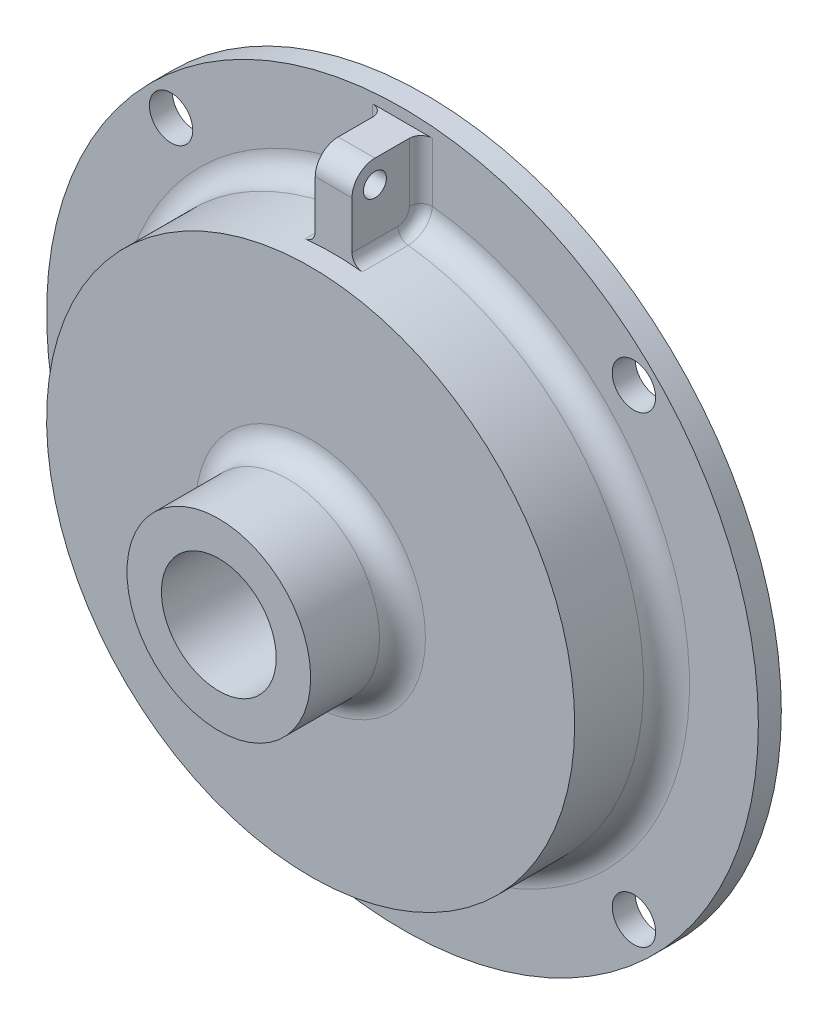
ISO-10303-21;
HEADER;
FILE_DESCRIPTION(('STEP AP214'),'2;1');
FILE_NAME('part.step','',(''),(''),'','','');
FILE_SCHEMA(('AUTOMOTIVE_DESIGN { 1 0 10303 214 1 1 1 1 }'));
ENDSEC;
DATA;
#1=APPLICATION_CONTEXT('core data for automotive mechanical design processes');
#2=APPLICATION_PROTOCOL_DEFINITION('international standard','automotive_design',2000,#1);
#3=PRODUCT_CONTEXT('',#1,'mechanical');
#4=PRODUCT('Part','Part','',(#3));
#5=PRODUCT_RELATED_PRODUCT_CATEGORY('part','',(#4));
#6=PRODUCT_DEFINITION_FORMATION('','',#4);
#7=PRODUCT_DEFINITION_CONTEXT('part definition',#1,'design');
#8=PRODUCT_DEFINITION('design','',#6,#7);
#9=PRODUCT_DEFINITION_SHAPE('','',#8);
#10=(LENGTH_UNIT() NAMED_UNIT(*) SI_UNIT(.MILLI.,.METRE.));
#11=(NAMED_UNIT(*) PLANE_ANGLE_UNIT() SI_UNIT($,.RADIAN.));
#12=(NAMED_UNIT(*) SI_UNIT($,.STERADIAN.) SOLID_ANGLE_UNIT());
#13=UNCERTAINTY_MEASURE_WITH_UNIT(LENGTH_MEASURE(1.E-05),#10,'distance_accuracy_value','');
#14=(GEOMETRIC_REPRESENTATION_CONTEXT(3) GLOBAL_UNCERTAINTY_ASSIGNED_CONTEXT((#13)) GLOBAL_UNIT_ASSIGNED_CONTEXT((#10,
#11,#12)) REPRESENTATION_CONTEXT('',''));
#15=CARTESIAN_POINT('',(0.,0.,0.));
#16=DIRECTION('',(0.,0.,1.));
#17=DIRECTION('',(1.,0.,0.));
#18=AXIS2_PLACEMENT_3D('',#15,#16,#17);
#19=CARTESIAN_POINT('',(0.,0.,3.175));
#20=DIRECTION('',(0.,0.,1.));
#21=DIRECTION('',(1.,0.,0.));
#22=AXIS2_PLACEMENT_3D('',#19,#20,#21);
#23=PLANE('',#22);
#24=CARTESIAN_POINT('',(31.9999999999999,32.0000000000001,3.175));
#25=DIRECTION('',(0.,0.,1.));
#26=DIRECTION('',(1.,0.,0.));
#27=AXIS2_PLACEMENT_3D('',#24,#25,#26);
#28=CIRCLE('',#27,2.99999999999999);
#29=CARTESIAN_POINT('',(34.9999999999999,32.0000000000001,3.175));
#30=VERTEX_POINT('',#29);
#31=EDGE_CURVE('E308',#30,#30,#28,.T.);
#32=ORIENTED_EDGE('',*,*,#31,.F.);
#33=EDGE_LOOP('',(#32));
#34=FACE_BOUND('',#33,.T.);
#35=CARTESIAN_POINT('',(-32.0000000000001,31.9999999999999,3.175));
#36=DIRECTION('',(0.,0.,1.));
#37=DIRECTION('',(1.,0.,0.));
#38=AXIS2_PLACEMENT_3D('',#35,#36,#37);
#39=CIRCLE('',#38,2.99999999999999);
#40=CARTESIAN_POINT('',(-29.0000000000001,31.9999999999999,3.175));
#41=VERTEX_POINT('',#40);
#42=EDGE_CURVE('E314',#41,#41,#39,.T.);
#43=ORIENTED_EDGE('',*,*,#42,.F.);
#44=EDGE_LOOP('',(#43));
#45=FACE_BOUND('',#44,.T.);
#46=CARTESIAN_POINT('',(-31.9999999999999,-32.0000000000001,3.175));
#47=DIRECTION('',(0.,0.,1.));
#48=DIRECTION('',(1.,0.,0.));
#49=AXIS2_PLACEMENT_3D('',#46,#47,#48);
#50=CIRCLE('',#49,2.99999999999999);
#51=CARTESIAN_POINT('',(-29.,-32.0000000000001,3.175));
#52=VERTEX_POINT('',#51);
#53=EDGE_CURVE('E320',#52,#52,#50,.T.);
#54=ORIENTED_EDGE('',*,*,#53,.F.);
#55=EDGE_LOOP('',(#54));
#56=FACE_BOUND('',#55,.T.);
#57=CARTESIAN_POINT('',(32.0000000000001,-31.9999999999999,3.175));
#58=DIRECTION('',(0.,0.,1.));
#59=DIRECTION('',(1.,0.,0.));
#60=AXIS2_PLACEMENT_3D('',#57,#58,#59);
#61=CIRCLE('',#60,2.99999999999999);
#62=CARTESIAN_POINT('',(35.0000000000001,-31.9999999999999,3.175));
#63=VERTEX_POINT('',#62);
#64=EDGE_CURVE('E326',#63,#63,#61,.T.);
#65=ORIENTED_EDGE('',*,*,#64,.F.);
#66=EDGE_LOOP('',(#65));
#67=FACE_BOUND('',#66,.T.);
#68=CARTESIAN_POINT('',(0.,0.,3.175));
#69=DIRECTION('',(0.,0.,1.));
#70=DIRECTION('',(1.,0.,0.));
#71=AXIS2_PLACEMENT_3D('',#68,#69,#70);
#72=CIRCLE('',#71,49.2125);
#73=CARTESIAN_POINT('',(49.2125,0.,3.175));
#74=VERTEX_POINT('',#73);
#75=EDGE_CURVE('E333',#74,#74,#72,.T.);
#76=ORIENTED_EDGE('',*,*,#75,.T.);
#77=EDGE_LOOP('',(#76));
#78=FACE_BOUND('',#77,.T.);
#79=DIRECTION('',(1.,0.,0.));
#80=VECTOR('',#79,1.);
#81=CARTESIAN_POINT('',(-2.54,47.625,3.175));
#82=LINE('',#81,#80);
#83=CARTESIAN_POINT('',(-4.1275,47.625,3.175));
#84=VERTEX_POINT('',#83);
#85=CARTESIAN_POINT('',(4.1275,47.625,3.175));
#86=VERTEX_POINT('',#85);
#87=EDGE_CURVE('E58',#84,#86,#82,.T.);
#88=ORIENTED_EDGE('',*,*,#87,.T.);
#89=DIRECTION('',(0.,-1.,0.));
#90=VECTOR('',#89,1.);
#91=CARTESIAN_POINT('',(4.1275,39.6061365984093,3.175));
#92=LINE('',#91,#90);
#93=CARTESIAN_POINT('',(4.1275,39.4722864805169,3.175));
#94=VERTEX_POINT('',#93);
#95=EDGE_CURVE('E253',#86,#94,#92,.T.);
#96=ORIENTED_EDGE('',*,*,#95,.T.);
#97=CARTESIAN_POINT('',(0.,0.,3.175));
#98=DIRECTION('',(0.,0.,1.));
#99=DIRECTION('',(1.,0.,0.));
#100=AXIS2_PLACEMENT_3D('',#97,#98,#99);
#101=CIRCLE('',#100,39.6875);
#102=CARTESIAN_POINT('',(-4.1275,39.4722864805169,3.175));
#103=VERTEX_POINT('',#102);
#104=EDGE_CURVE('E145',#94,#103,#101,.F.);
#105=ORIENTED_EDGE('',*,*,#104,.T.);
#106=DIRECTION('',(0.,-1.,0.));
#107=VECTOR('',#106,1.);
#108=CARTESIAN_POINT('',(-4.1275,0.,3.175));
#109=LINE('',#108,#107);
#110=EDGE_CURVE('E251',#103,#84,#109,.F.);
#111=ORIENTED_EDGE('',*,*,#110,.T.);
#112=EDGE_LOOP('',(#88,#96,#105,#111));
#113=FACE_BOUND('',#112,.T.);
#114=ADVANCED_FACE('F36',(#34,#45,#56,#67,#78,#113),#23,.T.);
#115=CARTESIAN_POINT('',(0.,0.,15.875));
#116=DIRECTION('',(0.,0.,-1.));
#117=DIRECTION('',(-1.,0.,0.));
#118=AXIS2_PLACEMENT_3D('',#115,#116,#117);
#119=CYLINDRICAL_SURFACE('',#118,36.5125);
#120=CARTESIAN_POINT('',(0.,0.,15.875));
#121=DIRECTION('',(0.,0.,1.));
#122=DIRECTION('',(1.,0.,0.));
#123=AXIS2_PLACEMENT_3D('',#120,#121,#122);
#124=CIRCLE('',#123,36.5125);
#125=CARTESIAN_POINT('',(36.5125,0.,15.875));
#126=VERTEX_POINT('',#125);
#127=EDGE_CURVE('E305',#126,#126,#124,.T.);
#128=ORIENTED_EDGE('',*,*,#127,.F.);
#129=EDGE_LOOP('',(#128));
#130=FACE_BOUND('',#129,.T.);
#131=CARTESIAN_POINT('',(0.,0.,6.35));
#132=DIRECTION('',(0.,0.,1.));
#133=DIRECTION('',(1.,0.,0.));
#134=AXIS2_PLACEMENT_3D('',#131,#132,#133);
#135=CIRCLE('',#134,36.5125);
#136=CARTESIAN_POINT('',(-3.95552083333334,36.2976102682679,6.35));
#137=VERTEX_POINT('',#136);
#138=CARTESIAN_POINT('',(3.95552083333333,36.2976102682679,6.35));
#139=VERTEX_POINT('',#138);
#140=EDGE_CURVE('E283',#137,#139,#135,.T.);
#141=ORIENTED_EDGE('',*,*,#140,.T.);
#142=DIRECTION('',(0.,0.,-1.));
#143=VECTOR('',#142,1.);
#144=CARTESIAN_POINT('',(3.95552083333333,36.2976102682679,15.875));
#145=LINE('',#144,#143);
#146=CARTESIAN_POINT('',(3.95552083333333,36.2976102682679,12.7));
#147=VERTEX_POINT('',#146);
#148=EDGE_CURVE('E151',#139,#147,#145,.F.);
#149=ORIENTED_EDGE('',*,*,#148,.T.);
#150=CARTESIAN_POINT('',(0.,0.,12.7));
#151=DIRECTION('',(0.,0.,-1.));
#152=DIRECTION('',(-1.,0.,0.));
#153=AXIS2_PLACEMENT_3D('',#150,#151,#152);
#154=CIRCLE('',#153,36.5125);
#155=CARTESIAN_POINT('',(-3.95552083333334,36.2976102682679,12.7));
#156=VERTEX_POINT('',#155);
#157=EDGE_CURVE('E142',#156,#147,#154,.T.);
#158=ORIENTED_EDGE('',*,*,#157,.F.);
#159=DIRECTION('',(0.,0.,-1.));
#160=VECTOR('',#159,1.);
#161=CARTESIAN_POINT('',(-3.95552083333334,36.2976102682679,15.875));
#162=LINE('',#161,#160);
#163=EDGE_CURVE('E136',#156,#137,#162,.T.);
#164=ORIENTED_EDGE('',*,*,#163,.T.);
#165=EDGE_LOOP('',(#141,#149,#158,#164));
#166=FACE_BOUND('',#165,.T.);
#167=ADVANCED_FACE('F345',(#130,#166),#119,.T.);
#168=CARTESIAN_POINT('',(0.,0.,6.35));
#169=DIRECTION('',(0.,0.,1.));
#170=DIRECTION('',(1.,0.,0.));
#171=AXIS2_PLACEMENT_3D('',#168,#169,#170);
#172=TOROIDAL_SURFACE('',#171,39.6875,3.175);
#173=ORIENTED_EDGE('',*,*,#104,.F.);
#174=CARTESIAN_POINT('',(4.18164310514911,40.5273921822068,3.35542367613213));
#175=CARTESIAN_POINT('',(2.54,40.5459208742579,3.30255416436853));
#176=CARTESIAN_POINT('',(2.54,40.0026513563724,4.85271183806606));
#177=CARTESIAN_POINT('',(4.17735707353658,40.4427545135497,3.32560729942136));
#178=CARTESIAN_POINT('',(2.54,40.4584003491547,3.27658082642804));
#179=CARTESIAN_POINT('',(2.54,39.96011140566,4.83780364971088));
#180=CARTESIAN_POINT('',(4.17299607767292,40.3569071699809,3.29939836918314));
#181=CARTESIAN_POINT('',(2.54,40.3698846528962,3.25440113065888));
#182=CARTESIAN_POINT('',(2.54,39.9169623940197,4.8246991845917));
#183=CARTESIAN_POINT('',(4.16414950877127,40.1833322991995,3.25433784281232));
#184=CARTESIAN_POINT('',(2.54,40.1916864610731,3.21776571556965));
#185=CARTESIAN_POINT('',(2.54,39.8297170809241,4.80216892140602));
#186=CARTESIAN_POINT('',(4.15966394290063,40.0956048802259,3.23548582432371));
#187=CARTESIAN_POINT('',(2.54,40.1020134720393,3.20328878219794));
#188=CARTESIAN_POINT('',(2.54,39.7856208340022,4.79274291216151));
#189=CARTESIAN_POINT('',(4.14607190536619,39.8306740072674,3.19022168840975));
#190=CARTESIAN_POINT('',(2.54,39.8327789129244,3.17154593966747));
#191=CARTESIAN_POINT('',(2.54,39.6524495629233,4.77011084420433));
#192=CARTESIAN_POINT('',(4.13681647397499,39.6514527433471,3.17500699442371));
#193=CARTESIAN_POINT('',(2.54,39.6519801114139,3.16566305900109));
#194=CARTESIAN_POINT('',(2.54,39.5623567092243,4.76250349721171));
#195=CARTESIAN_POINT('',(4.11817420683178,39.2929409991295,3.17499299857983));
#196=CARTESIAN_POINT('',(2.54,39.2934661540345,3.18429156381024));
#197=CARTESIAN_POINT('',(2.54,39.3821261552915,4.76249649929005));
#198=CARTESIAN_POINT('',(4.10878724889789,39.1136506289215,3.19022413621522));
#199=CARTESIAN_POINT('',(2.54,39.1157385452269,3.20865546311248));
#200=CARTESIAN_POINT('',(2.54,39.2919885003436,4.77011206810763));
#201=CARTESIAN_POINT('',(4.09015568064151,38.7601767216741,3.25070280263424));
#202=CARTESIAN_POINT('',(2.54,38.7683278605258,3.28634323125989));
#203=CARTESIAN_POINT('',(2.54,39.1142707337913,4.80035140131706));
#204=CARTESIAN_POINT('',(4.08091104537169,38.5859922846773,3.29594500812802));
#205=CARTESIAN_POINT('',(2.54,38.598573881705,3.3395012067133));
#206=CARTESIAN_POINT('',(2.54,39.0266901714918,4.82297250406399));
#207=CARTESIAN_POINT('',(4.06283875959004,38.2476492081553,3.41520930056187));
#208=CARTESIAN_POINT('',(2.54,38.2714996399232,3.47265785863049));
#209=CARTESIAN_POINT('',(2.54,38.8565608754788,4.88260465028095));
#210=CARTESIAN_POINT('',(4.05401116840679,38.0834919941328,3.48923546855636));
#211=CARTESIAN_POINT('',(2.54,38.1140639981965,3.5525334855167));
#212=CARTESIAN_POINT('',(2.54,38.7740128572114,4.91961773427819));
#213=CARTESIAN_POINT('',(4.03704864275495,37.7698994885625,3.66402328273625));
#214=CARTESIAN_POINT('',(2.54,37.8155483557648,3.73642917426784));
#215=CARTESIAN_POINT('',(2.54,38.6163119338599,5.00701164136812));
#216=CARTESIAN_POINT('',(4.02891377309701,37.6204655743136,3.76478742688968));
#217=CARTESIAN_POINT('',(2.54,37.6743195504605,3.8403710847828));
#218=CARTESIAN_POINT('',(2.54,38.541159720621,5.05739371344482));
#219=CARTESIAN_POINT('',(4.01362149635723,37.3409931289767,3.98996063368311));
#220=CARTESIAN_POINT('',(2.54,37.4119377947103,4.06894628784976));
#221=CARTESIAN_POINT('',(2.54,38.4006031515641,5.16998031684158));
#222=CARTESIAN_POINT('',(4.00646176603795,37.2109084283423,4.11431174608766));
#223=CARTESIAN_POINT('',(2.54,37.2905724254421,4.19350133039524));
#224=CARTESIAN_POINT('',(2.54,38.335175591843,5.23215587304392));
#225=CARTESIAN_POINT('',(3.99333719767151,36.9734608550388,4.38333826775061));
#226=CARTESIAN_POINT('',(2.54,37.0702855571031,4.45996271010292));
#227=CARTESIAN_POINT('',(2.54,38.2157441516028,5.36666913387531));
#228=CARTESIAN_POINT('',(3.98737253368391,36.8661012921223,4.52801663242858));
#229=CARTESIAN_POINT('',(2.54,36.971202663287,4.60190105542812));
#230=CARTESIAN_POINT('',(2.54,38.1617419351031,5.43900831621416));
#231=CARTESIAN_POINT('',(3.97687425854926,36.6777509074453,4.83284333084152));
#232=CARTESIAN_POINT('',(2.54,36.798155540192,4.89857518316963));
#233=CARTESIAN_POINT('',(2.54,38.0669983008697,5.59142166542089));
#234=CARTESIAN_POINT('',(3.97233377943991,36.5966334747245,4.99291240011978));
#235=CARTESIAN_POINT('',(2.54,36.7239275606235,5.05332299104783));
#236=CARTESIAN_POINT('',(2.54,38.0261932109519,5.67145620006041));
#237=CARTESIAN_POINT('',(3.96481003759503,36.4625045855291,5.3242894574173));
#238=CARTESIAN_POINT('',(2.54,36.6015930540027,5.37195514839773));
#239=CARTESIAN_POINT('',(2.54,37.9587200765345,5.83714472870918));
#240=CARTESIAN_POINT('',(3.96182512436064,36.4094633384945,5.49558531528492));
#241=CARTESIAN_POINT('',(2.54,36.5533484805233,5.53595146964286));
#242=CARTESIAN_POINT('',(2.54,37.9320370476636,5.9227926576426));
#243=CARTESIAN_POINT('',(3.95692027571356,36.3223814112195,5.89322764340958));
#244=CARTESIAN_POINT('',(2.54,36.4743136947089,5.91537906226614));
#245=CARTESIAN_POINT('',(2.54,37.8882290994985,6.12161382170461));
#246=CARTESIAN_POINT('',(3.9555216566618,36.2976254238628,6.12171939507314));
#247=CARTESIAN_POINT('',(2.54,36.4518799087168,6.13287630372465));
#248=CARTESIAN_POINT('',(2.54,37.8757748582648,6.23585969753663));
#249=CARTESIAN_POINT('',(3.95552019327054,36.2975984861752,6.52746734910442));
#250=CARTESIAN_POINT('',(2.54,36.4518555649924,6.51879379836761));
#251=CARTESIAN_POINT('',(2.54,37.8757613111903,6.43873367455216));
#252=CARTESIAN_POINT('',(3.95636433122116,36.3125391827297,6.70480708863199));
#253=CARTESIAN_POINT('',(2.54,36.4653926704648,6.68754708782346));
#254=CARTESIAN_POINT('',(2.54,37.8832776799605,6.52740354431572));
#255=CARTESIAN_POINT('',(3.959701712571,36.3717606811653,7.05520561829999));
#256=CARTESIAN_POINT('',(2.54,36.5191030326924,7.0215028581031));
#257=CARTESIAN_POINT('',(2.54,37.9130701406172,6.70260280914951));
#258=CARTESIAN_POINT('',(3.9622017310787,36.4161620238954,7.22824377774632));
#259=CARTESIAN_POINT('',(2.54,36.5594364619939,7.18684096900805));
#260=CARTESIAN_POINT('',(2.54,37.9354068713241,6.7891218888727));
#261=CARTESIAN_POINT('',(3.96550570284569,36.4749456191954,7.39635872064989));
#262=CARTESIAN_POINT('',(2.54,36.6129150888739,7.34791496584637));
#263=CARTESIAN_POINT('',(2.54,37.964978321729,6.87317936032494));
#264=(BOUNDED_SURFACE() B_SPLINE_SURFACE(3,2,((#174,#175,#176),(#177,#178,#179),(#180,#181,
#182),(#183,#184,#185),(#186,#187,#188),(#189,#190,#191),(#192,#193,#194),(#195,#196,#197),
(#198,#199,#200),(#201,#202,#203),(#204,#205,#206),(#207,#208,#209),(#210,#211,#212),(#213,#214,
#215),(#216,#217,#218),(#219,#220,#221),(#222,#223,#224),(#225,#226,#227),(#228,#229,#230),
(#231,#232,#233),(#234,#235,#236),(#237,#238,#239),(#240,#241,#242),(#243,#244,#245),(#246,#247,
#248),(#249,#250,#251),(#252,#253,#254),(#255,#256,#257),(#258,#259,#260),(#261,#262,#263)),
.UNSPECIFIED.,.F.,.F.,.F.) B_SPLINE_SURFACE_WITH_KNOTS((4,2,2,2,2,2,2,2,2,2,2,2,2,2,4),(3,3),
(0.,0.135146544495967,0.270285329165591,0.540138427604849,0.810261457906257,1.08033658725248,
1.35045002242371,1.62058870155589,1.89007208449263,2.15959468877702,2.42779682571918,
2.69571381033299,3.03757625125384,3.30334311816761,3.5702041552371),(0.,1.),
.UNSPECIFIED.) GEOMETRIC_REPRESENTATION_ITEM() RATIONAL_B_SPLINE_SURFACE(((1.,0.694943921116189,
1.),(1.,0.695915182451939,1.),(1.,0.696901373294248,1.),(1.,0.698897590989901,1.),(1.,
0.699907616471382,1.),(1.,0.702961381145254,1.),(1.,0.70503189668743,1.),(1.,0.709183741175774,
1.),(1.,0.711265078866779,1.),(1.,0.715378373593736,1.),(1.,0.717410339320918,1.),(1.,
0.721366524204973,1.),(1.,0.723290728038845,1.),(1.,0.726974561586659,1.),(1.,0.728734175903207,
1.),(1.,0.732031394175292,1.),(1.,0.733569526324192,1.),(1.,0.736381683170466,1.),(1.,
0.737655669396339,1.),(1.,0.739893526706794,1.),(1.,0.740858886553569,1.),(1.,0.742456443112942,
1.),(1.,0.743088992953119,1.),(1.,0.744127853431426,1.),(1.,0.744423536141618,1.),(1.,
0.744423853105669,1.),(1.,0.744245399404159,1.),(1.,0.743538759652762,1.),(1.,0.743009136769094,
1.),(1.,0.742308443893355,1.))) REPRESENTATION_ITEM('') SURFACE());
#265=CARTESIAN_POINT('',(4.18164310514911,40.5273921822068,3.35542367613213));
#266=CARTESIAN_POINT('',(4.17735707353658,40.4427545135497,3.32560729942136));
#267=CARTESIAN_POINT('',(4.17299607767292,40.3569071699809,3.29939836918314));
#268=CARTESIAN_POINT('',(4.16414950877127,40.1833322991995,3.25433784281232));
#269=CARTESIAN_POINT('',(4.15966394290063,40.0956048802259,3.23548582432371));
#270=CARTESIAN_POINT('',(4.14607190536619,39.8306740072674,3.19022168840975));
#271=CARTESIAN_POINT('',(4.13681647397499,39.6514527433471,3.17500699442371));
#272=CARTESIAN_POINT('',(4.11817420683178,39.2929409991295,3.17499299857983));
#273=CARTESIAN_POINT('',(4.10878724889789,39.1136506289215,3.19022413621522));
#274=CARTESIAN_POINT('',(4.09015568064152,38.7601767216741,3.25070280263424));
#275=CARTESIAN_POINT('',(4.08091104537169,38.5859922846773,3.29594500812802));
#276=CARTESIAN_POINT('',(4.06283875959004,38.2476492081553,3.41520930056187));
#277=CARTESIAN_POINT('',(4.05401116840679,38.0834919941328,3.48923546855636));
#278=CARTESIAN_POINT('',(4.03704864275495,37.7698994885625,3.66402328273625));
#279=CARTESIAN_POINT('',(4.02891377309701,37.6204655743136,3.76478742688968));
#280=CARTESIAN_POINT('',(4.01362149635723,37.3409931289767,3.98996063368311));
#281=CARTESIAN_POINT('',(4.00646176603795,37.2109084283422,4.11431174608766));
#282=CARTESIAN_POINT('',(3.99333719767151,36.9734608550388,4.38333826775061));
#283=CARTESIAN_POINT('',(3.98737253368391,36.8661012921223,4.52801663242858));
#284=CARTESIAN_POINT('',(3.97687425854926,36.6777509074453,4.83284333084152));
#285=CARTESIAN_POINT('',(3.97233377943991,36.5966334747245,4.99291240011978));
#286=CARTESIAN_POINT('',(3.96481003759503,36.4625045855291,5.3242894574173));
#287=CARTESIAN_POINT('',(3.96182512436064,36.4094633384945,5.49558531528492));
#288=CARTESIAN_POINT('',(3.95692027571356,36.3223814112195,5.89322764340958));
#289=CARTESIAN_POINT('',(3.9555216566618,36.2976254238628,6.12171939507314));
#290=CARTESIAN_POINT('',(3.95552019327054,36.2975984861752,6.52746734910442));
#291=CARTESIAN_POINT('',(3.95636433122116,36.3125391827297,6.70480708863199));
#292=CARTESIAN_POINT('',(3.959701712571,36.3717606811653,7.05520561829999));
#293=CARTESIAN_POINT('',(3.9622017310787,36.4161620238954,7.22824377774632));
#294=CARTESIAN_POINT('',(3.96550570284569,36.4749456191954,7.39635872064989));
#295=B_SPLINE_CURVE_WITH_KNOTS('',3,(#265,#266,#267,#268,#269,#270,#271,#272,#273,#274,#275,
#276,#277,#278,#279,#280,#281,#282,#283,#284,#285,#286,#287,#288,#289,#290,#291,#292,#293,#294),
.UNSPECIFIED.,.F.,.F.,(4,2,2,2,2,2,2,2,2,2,2,2,2,2,4),(0.,0.135146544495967,0.270285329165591,
0.540138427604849,0.810261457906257,1.08033658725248,1.35045002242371,1.62058870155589,
1.89007208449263,2.15959468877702,2.42779682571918,2.69571381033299,3.03757625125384,
3.30334311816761,3.5702041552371),.UNSPECIFIED.);
#296=EDGE_CURVE('E243',#94,#139,#295,.T.);
#297=ORIENTED_EDGE('',*,*,#296,.T.);
#298=ORIENTED_EDGE('',*,*,#140,.F.);
#299=CARTESIAN_POINT('',(-3.96550570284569,36.4749456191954,7.39635872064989));
#300=CARTESIAN_POINT('',(-2.54,36.6129150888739,7.34791496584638));
#301=CARTESIAN_POINT('',(-2.54,37.964978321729,6.87317936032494));
#302=CARTESIAN_POINT('',(-3.96386052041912,36.4456596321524,7.31244061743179));
#303=CARTESIAN_POINT('',(-2.54,36.5862605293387,7.26747359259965));
#304=CARTESIAN_POINT('',(-2.54,37.9502458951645,6.83122030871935));
#305=CARTESIAN_POINT('',(-3.96241213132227,36.4199078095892,7.22731888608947));
#306=CARTESIAN_POINT('',(-2.54,36.5628409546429,7.18600002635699));
#307=CARTESIAN_POINT('',(-2.54,37.9372912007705,6.78865944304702));
#308=CARTESIAN_POINT('',(-3.95991943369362,36.375622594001,7.05519929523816));
#309=CARTESIAN_POINT('',(-2.54,36.5226091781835,7.02153331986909));
#310=CARTESIAN_POINT('',(-2.54,37.9150129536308,6.70259964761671));
#311=CARTESIAN_POINT('',(-3.95887510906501,36.357088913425,6.96820151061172));
#312=CARTESIAN_POINT('',(-2.54,36.5057873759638,6.93852233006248));
#313=CARTESIAN_POINT('',(-2.54,37.9056892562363,6.6591007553));
#314=CARTESIAN_POINT('',(-3.95636653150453,36.3125856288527,6.70546681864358));
#315=CARTESIAN_POINT('',(-2.54,36.4654342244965,6.68817541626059));
#316=CARTESIAN_POINT('',(-2.54,37.8833010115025,6.5277334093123));
#317=CARTESIAN_POINT('',(-3.95552123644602,36.2976172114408,6.52771107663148));
#318=CARTESIAN_POINT('',(-2.54,36.4518725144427,6.51902588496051));
#319=CARTESIAN_POINT('',(-2.54,37.8757707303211,6.43885553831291));
#320=CARTESIAN_POINT('',(-3.9555204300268,36.2976033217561,6.17220346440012));
#321=CARTESIAN_POINT('',(-2.54,36.4518599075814,6.18089287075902));
#322=CARTESIAN_POINT('',(-2.54,37.8757637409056,6.26110173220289));
#323=CARTESIAN_POINT('',(-3.95636573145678,36.3125722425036,5.99445163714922));
#324=CARTESIAN_POINT('',(-2.54,36.4654220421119,6.01174700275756));
#325=CARTESIAN_POINT('',(-2.54,37.8832942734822,6.17222581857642));
#326=CARTESIAN_POINT('',(-3.95971478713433,36.3719843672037,5.64402081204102));
#327=CARTESIAN_POINT('',(-2.54,36.5193066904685,5.67775874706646));
#328=CARTESIAN_POINT('',(-2.54,37.9131827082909,5.99701040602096));
#329=CARTESIAN_POINT('',(-3.96221821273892,36.4164217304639,5.47134081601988));
#330=CARTESIAN_POINT('',(-2.54,36.559674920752,5.51276159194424));
#331=CARTESIAN_POINT('',(-2.54,37.9355376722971,5.91067040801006));
#332=CARTESIAN_POINT('',(-3.96879290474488,36.5334643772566,5.13595644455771));
#333=CARTESIAN_POINT('',(-2.54,36.6662507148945,5.19112038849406));
#334=CARTESIAN_POINT('',(-2.54,37.994416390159,5.74297822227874));
#335=CARTESIAN_POINT('',(-3.97286403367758,36.6060671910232,4.97325119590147));
#336=CARTESIAN_POINT('',(-2.54,36.732552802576,5.03434604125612));
#337=CARTESIAN_POINT('',(-2.54,38.0309389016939,5.66162559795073));
#338=CARTESIAN_POINT('',(-3.98243029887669,36.7773369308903,4.662347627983));
#339=CARTESIAN_POINT('',(-2.54,36.8895262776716,4.73299568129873));
#340=CARTESIAN_POINT('',(-2.54,38.1170922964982,5.50617381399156));
#341=CARTESIAN_POINT('',(-3.98792562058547,36.8760072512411,4.51415120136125));
#342=CARTESIAN_POINT('',(-2.54,36.9803334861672,4.58832951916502));
#343=CARTESIAN_POINT('',(-2.54,38.1667248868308,5.43207560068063));
#344=CARTESIAN_POINT('',(-4.00016593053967,37.096846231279,4.23606432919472));
#345=CARTESIAN_POINT('',(-2.54,37.1845533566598,4.314545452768));
#346=CARTESIAN_POINT('',(-2.54,38.2778052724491,5.29303216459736));
#347=CARTESIAN_POINT('',(-4.00691405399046,37.2190738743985,4.10622128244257));
#348=CARTESIAN_POINT('',(-2.54,37.2981778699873,4.18542455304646));
#349=CARTESIAN_POINT('',(-2.54,38.339282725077,5.22811064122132));
#350=CARTESIAN_POINT('',(-4.02142580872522,37.4833934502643,3.86886173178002));
#351=CARTESIAN_POINT('',(-2.54,37.5453465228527,3.94656479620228));
#352=CARTESIAN_POINT('',(-2.54,38.4722223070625,5.10943086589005));
#353=CARTESIAN_POINT('',(-4.02918961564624,37.6254888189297,3.76134909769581));
#354=CARTESIAN_POINT('',(-2.54,37.6790567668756,3.83683770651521));
#355=CARTESIAN_POINT('',(-2.54,38.5436861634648,5.05567454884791));
#356=CARTESIAN_POINT('',(-4.04552882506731,37.9263814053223,3.57106039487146));
#357=CARTESIAN_POINT('',(-2.54,37.9641416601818,3.63929294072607));
#358=CARTESIAN_POINT('',(-2.54,38.6950055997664,4.96053019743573));
#359=CARTESIAN_POINT('',(-4.05410876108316,38.0852725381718,3.48843456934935));
#360=CARTESIAN_POINT('',(-2.54,38.1157665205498,3.5516738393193));
#361=CARTESIAN_POINT('',(-2.54,38.7749083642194,4.9192172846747));
#362=CARTESIAN_POINT('',(-4.0717679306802,38.4144708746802,3.35110687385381));
#363=CARTESIAN_POINT('',(-2.54,38.4323282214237,3.40197931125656));
#364=CARTESIAN_POINT('',(-2.54,38.9404454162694,4.85055343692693));
#365=CARTESIAN_POINT('',(-4.08084670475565,38.5847676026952,3.29637976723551));
#366=CARTESIAN_POINT('',(-2.54,38.5973814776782,3.33999077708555));
#367=CARTESIAN_POINT('',(-2.54,39.0260744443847,4.82318988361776));
#368=CARTESIAN_POINT('',(-4.09623072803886,38.8753034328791,3.22931466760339));
#369=CARTESIAN_POINT('',(-2.54,38.8810436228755,3.25946594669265));
#370=CARTESIAN_POINT('',(-2.54,39.172154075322,4.78965733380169));
#371=CARTESIAN_POINT('',(-4.10247573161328,38.9937714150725,3.20897494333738));
#372=CARTESIAN_POINT('',(-2.54,38.9974684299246,3.23335877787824));
#373=CARTESIAN_POINT('',(-2.54,39.2317168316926,4.77948747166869));
#374=CARTESIAN_POINT('',(-4.11498864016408,39.2322281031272,3.18181315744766));
#375=CARTESIAN_POINT('',(-2.54,39.2331650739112,3.19421185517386));
#376=CARTESIAN_POINT('',(-2.54,39.3516024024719,4.76590657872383));
#377=CARTESIAN_POINT('',(-4.12125654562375,39.3522168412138,3.17499138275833));
#378=CARTESIAN_POINT('',(-2.54,39.3524524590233,3.18122275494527));
#379=CARTESIAN_POINT('',(-2.54,39.4119252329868,4.76249569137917));
#380=CARTESIAN_POINT('',(-4.13679822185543,39.6511032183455,3.17501283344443));
#381=CARTESIAN_POINT('',(-2.54,39.6516284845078,3.16568710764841));
#382=CARTESIAN_POINT('',(-2.54,39.5621809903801,4.76250641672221));
#383=CARTESIAN_POINT('',(-4.14604221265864,39.830099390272,3.19017507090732));
#384=CARTESIAN_POINT('',(-2.54,39.8321975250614,3.17152918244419));
#385=CARTESIAN_POINT('',(-2.54,39.6521607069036,4.77008753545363));
#386=CARTESIAN_POINT('',(-4.15962981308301,40.0949375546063,3.235346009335));
#387=CARTESIAN_POINT('',(-2.54,40.101332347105,3.20318244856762));
#388=CARTESIAN_POINT('',(-2.54,39.7852854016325,4.79267300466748));
#389=CARTESIAN_POINT('',(-4.16412306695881,40.1828141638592,3.25421340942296));
#390=CARTESIAN_POINT('',(-2.54,40.1911560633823,3.2176668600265));
#391=CARTESIAN_POINT('',(-2.54,39.8294566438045,4.80210670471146));
#392=CARTESIAN_POINT('',(-4.17298344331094,40.3566586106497,3.2993238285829));
#393=CARTESIAN_POINT('',(-2.54,40.3696287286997,3.25433836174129));
#394=CARTESIAN_POINT('',(-2.54,39.916837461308,4.82466191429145));
#395=CARTESIAN_POINT('',(-4.17735059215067,40.442626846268,3.32556529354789));
#396=CARTESIAN_POINT('',(-2.54,40.4582685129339,3.27654470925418));
#397=CARTESIAN_POINT('',(-2.54,39.960047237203,4.83778264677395));
#398=CARTESIAN_POINT('',(-4.18164310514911,40.5273921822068,3.35542367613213));
#399=CARTESIAN_POINT('',(-2.54,40.5459208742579,3.30255416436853));
#400=CARTESIAN_POINT('',(-2.54,40.0026513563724,4.85271183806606));
#401=(BOUNDED_SURFACE() B_SPLINE_SURFACE(3,2,((#299,#300,#301),(#302,#303,#304),(#305,#306,
#307),(#308,#309,#310),(#311,#312,#313),(#314,#315,#316),(#317,#318,#319),(#320,#321,#322),
(#323,#324,#325),(#326,#327,#328),(#329,#330,#331),(#332,#333,#334),(#335,#336,#337),(#338,#339,
#340),(#341,#342,#343),(#344,#345,#346),(#347,#348,#349),(#350,#351,#352),(#353,#354,#355),
(#356,#357,#358),(#359,#360,#361),(#362,#363,#364),(#365,#366,#367),(#368,#369,#370),(#371,#372,
#373),(#374,#375,#376),(#377,#378,#379),(#380,#381,#382),(#383,#384,#385),(#386,#387,#388),
(#389,#390,#391),(#392,#393,#394),(#395,#396,#397),(#398,#399,#400)),.UNSPECIFIED.,.F.,.F.,
.F.) B_SPLINE_SURFACE_WITH_KNOTS((4,2,2,2,2,2,2,2,2,2,2,2,2,2,2,2,4),(3,3),(0.,
0.133329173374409,0.266653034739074,0.532865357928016,0.799205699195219,1.06549326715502,
1.33175749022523,1.59805640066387,1.86503094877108,2.13205172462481,2.40065362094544,
2.66901211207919,2.84992337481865,3.0308384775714,3.30027085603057,3.4356386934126,
3.57097802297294),(0.,1.),
.UNSPECIFIED.) GEOMETRIC_REPRESENTATION_ITEM() RATIONAL_B_SPLINE_SURFACE(((1.,0.742308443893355,
1.),(1.,0.742657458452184,1.),(1.,0.74296449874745,1.),(1.,0.743492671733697,1.),(1.,
0.743713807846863,1.),(1.,0.744244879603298,1.),(1.,0.744423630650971,1.),(1.,0.744423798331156,
1.),(1.,0.744245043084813,1.),(1.,0.743536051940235,1.),(1.,0.743005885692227,1.),(1.,
0.741611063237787,1.),(1.,0.740746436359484,1.),(1.,0.738709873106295,1.),(1.,0.737537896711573,
1.),(1.,0.734919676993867,1.),(1.,0.733472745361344,1.),(1.,0.73035034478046,1.),(1.,
0.728674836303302,1.),(1.,0.725135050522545,1.),(1.,0.723269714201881,1.),(1.,0.71941442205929,
1.),(1.,0.717424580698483,1.),(1.,0.714038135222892,1.),(1.,0.712659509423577,1.),(1.,
0.709889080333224,1.),(1.,0.708497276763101,1.),(1.,0.705035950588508,1.),(1.,0.702968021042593,
1.),(1.,0.699915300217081,1.),(1.,0.69890355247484,1.),(1.,0.696904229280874,1.),(1.,
0.69591664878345,1.),(1.,0.694943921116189,1.))) REPRESENTATION_ITEM('') SURFACE());
#402=CARTESIAN_POINT('',(-3.96550570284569,36.4749456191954,7.39635872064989));
#403=CARTESIAN_POINT('',(-3.96386052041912,36.4456596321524,7.31244061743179));
#404=CARTESIAN_POINT('',(-3.96241213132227,36.4199078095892,7.22731888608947));
#405=CARTESIAN_POINT('',(-3.95991943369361,36.375622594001,7.05519929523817));
#406=CARTESIAN_POINT('',(-3.95887510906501,36.357088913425,6.96820151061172));
#407=CARTESIAN_POINT('',(-3.95636653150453,36.3125856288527,6.70546681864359));
#408=CARTESIAN_POINT('',(-3.95552123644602,36.2976172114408,6.52771107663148));
#409=CARTESIAN_POINT('',(-3.9555204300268,36.2976033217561,6.17220346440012));
#410=CARTESIAN_POINT('',(-3.95636573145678,36.3125722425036,5.99445163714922));
#411=CARTESIAN_POINT('',(-3.95971478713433,36.3719843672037,5.64402081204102));
#412=CARTESIAN_POINT('',(-3.96221821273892,36.4164217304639,5.47134081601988));
#413=CARTESIAN_POINT('',(-3.96879290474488,36.5334643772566,5.13595644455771));
#414=CARTESIAN_POINT('',(-3.97286403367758,36.6060671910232,4.97325119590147));
#415=CARTESIAN_POINT('',(-3.98243029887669,36.7773369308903,4.662347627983));
#416=CARTESIAN_POINT('',(-3.98792562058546,36.8760072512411,4.51415120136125));
#417=CARTESIAN_POINT('',(-4.00016593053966,37.096846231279,4.23606432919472));
#418=CARTESIAN_POINT('',(-4.00691405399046,37.2190738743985,4.10622128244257));
#419=CARTESIAN_POINT('',(-4.02142580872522,37.4833934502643,3.86886173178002));
#420=CARTESIAN_POINT('',(-4.02918961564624,37.6254888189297,3.76134909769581));
#421=CARTESIAN_POINT('',(-4.04552882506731,37.9263814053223,3.57106039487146));
#422=CARTESIAN_POINT('',(-4.05410876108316,38.0852725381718,3.48843456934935));
#423=CARTESIAN_POINT('',(-4.0717679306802,38.4144708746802,3.35110687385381));
#424=CARTESIAN_POINT('',(-4.08084670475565,38.5847676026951,3.29637976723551));
#425=CARTESIAN_POINT('',(-4.09623072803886,38.8753034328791,3.22931466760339));
#426=CARTESIAN_POINT('',(-4.10247573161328,38.9937714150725,3.20897494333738));
#427=CARTESIAN_POINT('',(-4.11498864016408,39.2322281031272,3.18181315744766));
#428=CARTESIAN_POINT('',(-4.12125654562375,39.3522168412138,3.17499138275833));
#429=CARTESIAN_POINT('',(-4.13679822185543,39.6511032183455,3.17501283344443));
#430=CARTESIAN_POINT('',(-4.14604221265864,39.830099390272,3.19017507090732));
#431=CARTESIAN_POINT('',(-4.15962981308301,40.0949375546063,3.235346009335));
#432=CARTESIAN_POINT('',(-4.16412306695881,40.1828141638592,3.25421340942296));
#433=CARTESIAN_POINT('',(-4.17298344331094,40.3566586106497,3.2993238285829));
#434=CARTESIAN_POINT('',(-4.17735059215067,40.442626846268,3.32556529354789));
#435=CARTESIAN_POINT('',(-4.18164310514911,40.5273921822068,3.35542367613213));
#436=B_SPLINE_CURVE_WITH_KNOTS('',3,(#402,#403,#404,#405,#406,#407,#408,#409,#410,#411,#412,
#413,#414,#415,#416,#417,#418,#419,#420,#421,#422,#423,#424,#425,#426,#427,#428,#429,#430,#431,
#432,#433,#434,#435),.UNSPECIFIED.,.F.,.F.,(4,2,2,2,2,2,2,2,2,2,2,2,2,2,2,2,4),(0.,
0.133329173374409,0.266653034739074,0.532865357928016,0.799205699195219,1.06549326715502,
1.33175749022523,1.59805640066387,1.86503094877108,2.13205172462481,2.40065362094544,
2.66901211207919,2.84992337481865,3.0308384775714,3.30027085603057,3.4356386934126,
3.57097802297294),.UNSPECIFIED.);
#437=EDGE_CURVE('E237',#137,#103,#436,.T.);
#438=ORIENTED_EDGE('',*,*,#437,.T.);
#439=EDGE_LOOP('',(#173,#297,#298,#438));
#440=FACE_BOUND('',#439,.T.);
#441=ADVANCED_FACE('F191',(#440),#172,.F.);
#442=CARTESIAN_POINT('',(0.,0.,15.875));
#443=DIRECTION('',(0.,0.,1.));
#444=DIRECTION('',(1.,0.,0.));
#445=AXIS2_PLACEMENT_3D('',#442,#443,#444);
#446=PLANE('',#445);
#447=CARTESIAN_POINT('',(0.,0.,15.875));
#448=DIRECTION('',(0.,0.,1.));
#449=DIRECTION('',(1.,0.,0.));
#450=AXIS2_PLACEMENT_3D('',#447,#448,#449);
#451=CIRCLE('',#450,15.875);
#452=CARTESIAN_POINT('',(15.875,0.,15.875));
#453=VERTEX_POINT('',#452);
#454=EDGE_CURVE('E341',#453,#453,#451,.F.);
#455=ORIENTED_EDGE('',*,*,#454,.T.);
#456=EDGE_LOOP('',(#455));
#457=FACE_BOUND('',#456,.T.);
#458=ORIENTED_EDGE('',*,*,#127,.T.);
#459=EDGE_LOOP('',(#458));
#460=FACE_BOUND('',#459,.T.);
#461=ADVANCED_FACE('F371',(#457,#460),#446,.T.);
#462=CARTESIAN_POINT('',(0.,0.,3.175));
#463=DIRECTION('',(0.,0.,-1.));
#464=DIRECTION('',(-1.,0.,0.));
#465=AXIS2_PLACEMENT_3D('',#462,#463,#464);
#466=CYLINDRICAL_SURFACE('',#465,49.2125);
#467=ORIENTED_EDGE('',*,*,#75,.F.);
#468=EDGE_LOOP('',(#467));
#469=FACE_BOUND('',#468,.T.);
#470=CARTESIAN_POINT('',(0.,0.,0.));
#471=DIRECTION('',(0.,0.,1.));
#472=DIRECTION('',(1.,0.,0.));
#473=AXIS2_PLACEMENT_3D('',#470,#471,#472);
#474=CIRCLE('',#473,49.2125);
#475=CARTESIAN_POINT('',(49.2125,0.,0.));
#476=VERTEX_POINT('',#475);
#477=EDGE_CURVE('E332',#476,#476,#474,.T.);
#478=ORIENTED_EDGE('',*,*,#477,.T.);
#479=EDGE_LOOP('',(#478));
#480=FACE_BOUND('',#479,.T.);
#481=ADVANCED_FACE('F368',(#469,#480),#466,.T.);
#482=CARTESIAN_POINT('',(0.,0.,0.));
#483=DIRECTION('',(0.,0.,1.));
#484=DIRECTION('',(1.,0.,0.));
#485=AXIS2_PLACEMENT_3D('',#482,#483,#484);
#486=PLANE('',#485);
#487=CARTESIAN_POINT('',(0.,0.,0.));
#488=DIRECTION('',(0.,0.,1.));
#489=DIRECTION('',(1.,0.,0.));
#490=AXIS2_PLACEMENT_3D('',#487,#488,#489);
#491=CIRCLE('',#490,7.9375);
#492=CARTESIAN_POINT('',(7.9375,0.,0.));
#493=VERTEX_POINT('',#492);
#494=EDGE_CURVE('E296',#493,#493,#491,.T.);
#495=ORIENTED_EDGE('',*,*,#494,.T.);
#496=EDGE_LOOP('',(#495));
#497=FACE_BOUND('',#496,.T.);
#498=CARTESIAN_POINT('',(31.9999999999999,32.0000000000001,1.18221404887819E-12));
#499=DIRECTION('',(0.,0.,1.));
#500=DIRECTION('',(1.,0.,0.));
#501=AXIS2_PLACEMENT_3D('',#498,#499,#500);
#502=CIRCLE('',#501,3.);
#503=CARTESIAN_POINT('',(34.9999999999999,32.0000000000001,1.18221404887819E-12));
#504=VERTEX_POINT('',#503);
#505=EDGE_CURVE('E311',#504,#504,#502,.T.);
#506=ORIENTED_EDGE('',*,*,#505,.T.);
#507=EDGE_LOOP('',(#506));
#508=FACE_BOUND('',#507,.T.);
#509=CARTESIAN_POINT('',(-32.0000000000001,31.9999999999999,1.18221404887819E-12));
#510=DIRECTION('',(0.,0.,1.));
#511=DIRECTION('',(1.,0.,0.));
#512=AXIS2_PLACEMENT_3D('',#509,#510,#511);
#513=CIRCLE('',#512,3.);
#514=CARTESIAN_POINT('',(-29.0000000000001,31.9999999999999,1.18221404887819E-12));
#515=VERTEX_POINT('',#514);
#516=EDGE_CURVE('E317',#515,#515,#513,.T.);
#517=ORIENTED_EDGE('',*,*,#516,.T.);
#518=EDGE_LOOP('',(#517));
#519=FACE_BOUND('',#518,.T.);
#520=CARTESIAN_POINT('',(-31.9999999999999,-32.0000000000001,1.18221404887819E-12));
#521=DIRECTION('',(0.,0.,1.));
#522=DIRECTION('',(1.,0.,0.));
#523=AXIS2_PLACEMENT_3D('',#520,#521,#522);
#524=CIRCLE('',#523,3.);
#525=CARTESIAN_POINT('',(-28.9999999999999,-32.0000000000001,1.18221404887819E-12));
#526=VERTEX_POINT('',#525);
#527=EDGE_CURVE('E323',#526,#526,#524,.T.);
#528=ORIENTED_EDGE('',*,*,#527,.T.);
#529=EDGE_LOOP('',(#528));
#530=FACE_BOUND('',#529,.T.);
#531=CARTESIAN_POINT('',(32.0000000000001,-31.9999999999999,1.18221404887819E-12));
#532=DIRECTION('',(0.,0.,1.));
#533=DIRECTION('',(1.,0.,0.));
#534=AXIS2_PLACEMENT_3D('',#531,#532,#533);
#535=CIRCLE('',#534,3.);
#536=CARTESIAN_POINT('',(35.0000000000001,-31.9999999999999,1.18221404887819E-12));
#537=VERTEX_POINT('',#536);
#538=EDGE_CURVE('E329',#537,#537,#535,.T.);
#539=ORIENTED_EDGE('',*,*,#538,.T.);
#540=EDGE_LOOP('',(#539));
#541=FACE_BOUND('',#540,.T.);
#542=ORIENTED_EDGE('',*,*,#477,.F.);
#543=EDGE_LOOP('',(#542));
#544=FACE_BOUND('',#543,.T.);
#545=ADVANCED_FACE('F365',(#497,#508,#519,#530,#541,#544),#486,.F.);
#546=CARTESIAN_POINT('',(32.0000000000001,-31.9999999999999,3.175));
#547=DIRECTION('',(0.,0.,1.));
#548=DIRECTION('',(1.,0.,0.));
#549=AXIS2_PLACEMENT_3D('',#546,#547,#548);
#550=CYLINDRICAL_SURFACE('',#549,2.99999999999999);
#551=ORIENTED_EDGE('',*,*,#538,.F.);
#552=EDGE_LOOP('',(#551));
#553=FACE_BOUND('',#552,.T.);
#554=ORIENTED_EDGE('',*,*,#64,.T.);
#555=EDGE_LOOP('',(#554));
#556=FACE_BOUND('',#555,.T.);
#557=ADVANCED_FACE('F363',(#553,#556),#550,.F.);
#558=CARTESIAN_POINT('',(-31.9999999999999,-32.0000000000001,3.175));
#559=DIRECTION('',(0.,0.,1.));
#560=DIRECTION('',(1.,0.,0.));
#561=AXIS2_PLACEMENT_3D('',#558,#559,#560);
#562=CYLINDRICAL_SURFACE('',#561,2.99999999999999);
#563=ORIENTED_EDGE('',*,*,#527,.F.);
#564=EDGE_LOOP('',(#563));
#565=FACE_BOUND('',#564,.T.);
#566=ORIENTED_EDGE('',*,*,#53,.T.);
#567=EDGE_LOOP('',(#566));
#568=FACE_BOUND('',#567,.T.);
#569=ADVANCED_FACE('F404',(#565,#568),#562,.F.);
#570=CARTESIAN_POINT('',(-32.0000000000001,31.9999999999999,3.175));
#571=DIRECTION('',(0.,0.,1.));
#572=DIRECTION('',(1.,0.,0.));
#573=AXIS2_PLACEMENT_3D('',#570,#571,#572);
#574=CYLINDRICAL_SURFACE('',#573,2.99999999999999);
#575=ORIENTED_EDGE('',*,*,#516,.F.);
#576=EDGE_LOOP('',(#575));
#577=FACE_BOUND('',#576,.T.);
#578=ORIENTED_EDGE('',*,*,#42,.T.);
#579=EDGE_LOOP('',(#578));
#580=FACE_BOUND('',#579,.T.);
#581=ADVANCED_FACE('F396',(#577,#580),#574,.F.);
#582=CARTESIAN_POINT('',(31.9999999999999,32.0000000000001,3.175));
#583=DIRECTION('',(0.,0.,1.));
#584=DIRECTION('',(1.,0.,0.));
#585=AXIS2_PLACEMENT_3D('',#582,#583,#584);
#586=CYLINDRICAL_SURFACE('',#585,2.99999999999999);
#587=ORIENTED_EDGE('',*,*,#505,.F.);
#588=EDGE_LOOP('',(#587));
#589=FACE_BOUND('',#588,.T.);
#590=ORIENTED_EDGE('',*,*,#31,.T.);
#591=EDGE_LOOP('',(#590));
#592=FACE_BOUND('',#591,.T.);
#593=ADVANCED_FACE('F389',(#589,#592),#586,.F.);
#594=CARTESIAN_POINT('',(0.,0.,28.575));
#595=DIRECTION('',(0.,0.,-1.));
#596=DIRECTION('',(-1.,0.,0.));
#597=AXIS2_PLACEMENT_3D('',#594,#595,#596);
#598=CYLINDRICAL_SURFACE('',#597,12.7);
#599=CARTESIAN_POINT('',(0.,0.,19.05));
#600=DIRECTION('',(0.,0.,1.));
#601=DIRECTION('',(1.,0.,0.));
#602=AXIS2_PLACEMENT_3D('',#599,#600,#601);
#603=CIRCLE('',#602,12.7);
#604=CARTESIAN_POINT('',(12.7,0.,19.05));
#605=VERTEX_POINT('',#604);
#606=EDGE_CURVE('E336',#605,#605,#603,.T.);
#607=ORIENTED_EDGE('',*,*,#606,.T.);
#608=EDGE_LOOP('',(#607));
#609=FACE_BOUND('',#608,.T.);
#610=CARTESIAN_POINT('',(0.,0.,28.575));
#611=DIRECTION('',(0.,0.,1.));
#612=DIRECTION('',(1.,0.,0.));
#613=AXIS2_PLACEMENT_3D('',#610,#611,#612);
#614=CIRCLE('',#613,12.7);
#615=CARTESIAN_POINT('',(12.7,0.,28.575));
#616=VERTEX_POINT('',#615);
#617=EDGE_CURVE('E301',#616,#616,#614,.T.);
#618=ORIENTED_EDGE('',*,*,#617,.F.);
#619=EDGE_LOOP('',(#618));
#620=FACE_BOUND('',#619,.T.);
#621=ADVANCED_FACE('F381',(#609,#620),#598,.T.);
#622=CARTESIAN_POINT('',(0.,0.,28.575));
#623=DIRECTION('',(0.,0.,1.));
#624=DIRECTION('',(1.,0.,0.));
#625=AXIS2_PLACEMENT_3D('',#622,#623,#624);
#626=PLANE('',#625);
#627=CARTESIAN_POINT('',(0.,0.,28.575));
#628=DIRECTION('',(0.,0.,1.));
#629=DIRECTION('',(1.,0.,0.));
#630=AXIS2_PLACEMENT_3D('',#627,#628,#629);
#631=CIRCLE('',#630,7.9375);
#632=CARTESIAN_POINT('',(7.9375,0.,28.575));
#633=VERTEX_POINT('',#632);
#634=EDGE_CURVE('E563',#633,#633,#631,.T.);
#635=ORIENTED_EDGE('',*,*,#634,.F.);
#636=EDGE_LOOP('',(#635));
#637=FACE_BOUND('',#636,.T.);
#638=ORIENTED_EDGE('',*,*,#617,.T.);
#639=EDGE_LOOP('',(#638));
#640=FACE_BOUND('',#639,.T.);
#641=ADVANCED_FACE('F375',(#637,#640),#626,.T.);
#642=CARTESIAN_POINT('',(0.,0.,19.05));
#643=DIRECTION('',(0.,0.,1.));
#644=DIRECTION('',(1.,0.,0.));
#645=AXIS2_PLACEMENT_3D('',#642,#643,#644);
#646=TOROIDAL_SURFACE('',#645,15.875,3.175);
#647=ORIENTED_EDGE('',*,*,#454,.F.);
#648=EDGE_LOOP('',(#647));
#649=FACE_BOUND('',#648,.T.);
#650=ORIENTED_EDGE('',*,*,#606,.F.);
#651=EDGE_LOOP('',(#650));
#652=FACE_BOUND('',#651,.T.);
#653=ADVANCED_FACE('F373',(#649,#652),#646,.F.);
#654=CARTESIAN_POINT('',(-2.54,47.625,12.7));
#655=DIRECTION('',(0.,0.,-1.));
#656=DIRECTION('',(-1.,0.,0.));
#657=AXIS2_PLACEMENT_3D('',#654,#655,#656);
#658=PLANE('',#657);
#659=DIRECTION('',(0.,-1.,0.));
#660=VECTOR('',#659,1.);
#661=CARTESIAN_POINT('',(2.54,47.625,12.7));
#662=LINE('',#661,#660);
#663=CARTESIAN_POINT('',(2.54,44.45,12.7));
#664=VERTEX_POINT('',#663);
#665=CARTESIAN_POINT('',(2.54,37.8757672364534,12.7));
#666=VERTEX_POINT('',#665);
#667=EDGE_CURVE('E124',#664,#666,#662,.T.);
#668=ORIENTED_EDGE('',*,*,#667,.F.);
#669=DIRECTION('',(1.,0.,0.));
#670=VECTOR('',#669,1.);
#671=CARTESIAN_POINT('',(-2.54,44.45,12.7));
#672=LINE('',#671,#670);
#673=CARTESIAN_POINT('',(-2.54,44.45,12.7));
#674=VERTEX_POINT('',#673);
#675=EDGE_CURVE('E137',#664,#674,#672,.F.);
#676=ORIENTED_EDGE('',*,*,#675,.T.);
#677=DIRECTION('',(0.,-1.,0.));
#678=VECTOR('',#677,1.);
#679=CARTESIAN_POINT('',(-2.54,47.625,12.7));
#680=LINE('',#679,#678);
#681=CARTESIAN_POINT('',(-2.54,37.8757672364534,12.7));
#682=VERTEX_POINT('',#681);
#683=EDGE_CURVE('E133',#674,#682,#680,.T.);
#684=ORIENTED_EDGE('',*,*,#683,.T.);
#685=CARTESIAN_POINT('',(-4.1275,37.8757672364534,12.7));
#686=DIRECTION('',(0.,0.,-1.));
#687=DIRECTION('',(-1.,0.,0.));
#688=AXIS2_PLACEMENT_3D('',#685,#686,#687);
#689=CIRCLE('',#688,1.5875);
#690=EDGE_CURVE('E257',#682,#156,#689,.T.);
#691=ORIENTED_EDGE('',*,*,#690,.T.);
#692=ORIENTED_EDGE('',*,*,#157,.T.);
#693=CARTESIAN_POINT('',(4.1275,37.8757672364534,12.7));
#694=DIRECTION('',(0.,0.,-1.));
#695=DIRECTION('',(-1.,0.,0.));
#696=AXIS2_PLACEMENT_3D('',#693,#694,#695);
#697=CIRCLE('',#696,1.5875);
#698=EDGE_CURVE('E255',#147,#666,#697,.T.);
#699=ORIENTED_EDGE('',*,*,#698,.T.);
#700=EDGE_LOOP('',(#668,#676,#684,#691,#692,#699));
#701=FACE_BOUND('',#700,.T.);
#702=ADVANCED_FACE('F223',(#701),#658,.F.);
#703=CARTESIAN_POINT('',(-2.54,47.625,3.175));
#704=DIRECTION('',(1.,0.,0.));
#705=DIRECTION('',(0.,0.,-1.));
#706=AXIS2_PLACEMENT_3D('',#703,#704,#705);
#707=PLANE('',#706);
#708=CARTESIAN_POINT('',(-2.54,44.45,9.525));
#709=DIRECTION('',(1.,0.,0.));
#710=DIRECTION('',(0.,0.,-1.));
#711=AXIS2_PLACEMENT_3D('',#708,#709,#710);
#712=CIRCLE('',#711,1.5875);
#713=CARTESIAN_POINT('',(-2.53999999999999,44.45,7.9375));
#714=VERTEX_POINT('',#713);
#715=EDGE_CURVE('E560',#714,#714,#712,.F.);
#716=ORIENTED_EDGE('',*,*,#715,.F.);
#717=EDGE_LOOP('',(#716));
#718=FACE_BOUND('',#717,.T.);
#719=CARTESIAN_POINT('',(-2.54,40.0026513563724,4.85271183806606));
#720=CARTESIAN_POINT('',(-2.54,39.960047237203,4.83778264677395));
#721=CARTESIAN_POINT('',(-2.54,39.916837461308,4.82466191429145));
#722=CARTESIAN_POINT('',(-2.54,39.8294566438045,4.80210670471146));
#723=CARTESIAN_POINT('',(-2.54,39.7852854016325,4.79267300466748));
#724=CARTESIAN_POINT('',(-2.54,39.6521607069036,4.77008753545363));
#725=CARTESIAN_POINT('',(-2.54,39.5621809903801,4.76250641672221));
#726=CARTESIAN_POINT('',(-2.54,39.4119252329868,4.76249569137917));
#727=CARTESIAN_POINT('',(-2.54,39.3516024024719,4.76590657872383));
#728=CARTESIAN_POINT('',(-2.54,39.2317168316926,4.77948747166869));
#729=CARTESIAN_POINT('',(-2.54,39.172154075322,4.78965733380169));
#730=CARTESIAN_POINT('',(-2.54,39.0260744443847,4.82318988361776));
#731=CARTESIAN_POINT('',(-2.54,38.9404454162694,4.85055343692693));
#732=CARTESIAN_POINT('',(-2.54,38.7749083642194,4.9192172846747));
#733=CARTESIAN_POINT('',(-2.54,38.6950055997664,4.96053019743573));
#734=CARTESIAN_POINT('',(-2.54,38.5436861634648,5.05567454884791));
#735=CARTESIAN_POINT('',(-2.54,38.4722223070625,5.10943086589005));
#736=CARTESIAN_POINT('',(-2.54,38.339282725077,5.22811064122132));
#737=CARTESIAN_POINT('',(-2.54,38.2778052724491,5.29303216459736));
#738=CARTESIAN_POINT('',(-2.54,38.1667248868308,5.43207560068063));
#739=CARTESIAN_POINT('',(-2.54,38.1170922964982,5.50617381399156));
#740=CARTESIAN_POINT('',(-2.54,38.0309389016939,5.66162559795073));
#741=CARTESIAN_POINT('',(-2.54,37.994416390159,5.74297822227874));
#742=CARTESIAN_POINT('',(-2.54,37.9355376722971,5.91067040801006));
#743=CARTESIAN_POINT('',(-2.54,37.9131827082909,5.99701040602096));
#744=CARTESIAN_POINT('',(-2.54,37.8832942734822,6.17222581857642));
#745=CARTESIAN_POINT('',(-2.54,37.8757637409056,6.26110173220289));
#746=CARTESIAN_POINT('',(-2.54,37.8757707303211,6.43885553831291));
#747=CARTESIAN_POINT('',(-2.54,37.8833010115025,6.5277334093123));
#748=CARTESIAN_POINT('',(-2.54,37.9056892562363,6.6591007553));
#749=CARTESIAN_POINT('',(-2.54,37.9150129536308,6.70259964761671));
#750=CARTESIAN_POINT('',(-2.54,37.9372912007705,6.78865944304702));
#751=CARTESIAN_POINT('',(-2.54,37.9502458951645,6.83122030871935));
#752=CARTESIAN_POINT('',(-2.54,37.964978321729,6.87317936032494));
#753=B_SPLINE_CURVE_WITH_KNOTS('',3,(#719,#720,#721,#722,#723,#724,#725,#726,#727,#728,#729,
#730,#731,#732,#733,#734,#735,#736,#737,#738,#739,#740,#741,#742,#743,#744,#745,#746,#747,#748,
#749,#750,#751,#752),.UNSPECIFIED.,.F.,.F.,(4,2,2,2,2,2,2,2,2,2,2,2,2,2,2,2,4),(0.,
0.135339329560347,0.27070716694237,0.540139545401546,0.721054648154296,0.90196591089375,
1.17032440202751,1.43892629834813,1.70594707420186,1.97292162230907,2.23922053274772,
2.50548475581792,2.77177232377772,3.03811266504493,3.30432498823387,3.43764884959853,
3.57097802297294),.UNSPECIFIED.);
#754=CARTESIAN_POINT('',(-2.54,39.4722864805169,4.7625));
#755=VERTEX_POINT('',#754);
#756=CARTESIAN_POINT('',(-2.54,37.8757672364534,6.35));
#757=VERTEX_POINT('',#756);
#758=EDGE_CURVE('E228',#755,#757,#753,.T.);
#759=ORIENTED_EDGE('',*,*,#758,.T.);
#760=DIRECTION('',(0.,0.,1.));
#761=VECTOR('',#760,1.);
#762=CARTESIAN_POINT('',(-2.54,37.8757672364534,12.7));
#763=LINE('',#762,#761);
#764=EDGE_CURVE('E234',#757,#682,#763,.T.);
#765=ORIENTED_EDGE('',*,*,#764,.T.);
#766=ORIENTED_EDGE('',*,*,#683,.F.);
#767=CARTESIAN_POINT('',(-2.54,44.45,9.525));
#768=DIRECTION('',(1.,0.,0.));
#769=DIRECTION('',(0.,0.,-1.));
#770=AXIS2_PLACEMENT_3D('',#767,#768,#769);
#771=CIRCLE('',#770,3.175);
#772=CARTESIAN_POINT('',(-2.54,47.625,9.525));
#773=VERTEX_POINT('',#772);
#774=EDGE_CURVE('E129',#674,#773,#771,.F.);
#775=ORIENTED_EDGE('',*,*,#774,.T.);
#776=DIRECTION('',(0.,0.,1.));
#777=VECTOR('',#776,1.);
#778=CARTESIAN_POINT('',(-2.54,47.625,3.175));
#779=LINE('',#778,#777);
#780=CARTESIAN_POINT('',(-2.54,47.625,4.7625));
#781=VERTEX_POINT('',#780);
#782=EDGE_CURVE('E115',#781,#773,#779,.T.);
#783=ORIENTED_EDGE('',*,*,#782,.F.);
#784=DIRECTION('',(0.,-1.,0.));
#785=VECTOR('',#784,1.);
#786=CARTESIAN_POINT('',(-2.54,47.625,4.7625));
#787=LINE('',#786,#785);
#788=EDGE_CURVE('E235',#781,#755,#787,.T.);
#789=ORIENTED_EDGE('',*,*,#788,.T.);
#790=EDGE_LOOP('',(#759,#765,#766,#775,#783,#789));
#791=FACE_BOUND('',#790,.T.);
#792=ADVANCED_FACE('F130',(#718,#791),#707,.F.);
#793=CARTESIAN_POINT('',(2.54,47.625,3.175));
#794=DIRECTION('',(1.,0.,0.));
#795=DIRECTION('',(0.,0.,-1.));
#796=AXIS2_PLACEMENT_3D('',#793,#794,#795);
#797=PLANE('',#796);
#798=CARTESIAN_POINT('',(2.54,44.45,9.525));
#799=DIRECTION('',(1.,0.,0.));
#800=DIRECTION('',(0.,0.,-1.));
#801=AXIS2_PLACEMENT_3D('',#798,#799,#800);
#802=CIRCLE('',#801,1.5875);
#803=CARTESIAN_POINT('',(2.53999999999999,44.45,7.9375));
#804=VERTEX_POINT('',#803);
#805=EDGE_CURVE('E268',#804,#804,#802,.T.);
#806=ORIENTED_EDGE('',*,*,#805,.F.);
#807=EDGE_LOOP('',(#806));
#808=FACE_BOUND('',#807,.T.);
#809=ORIENTED_EDGE('',*,*,#667,.T.);
#810=DIRECTION('',(0.,0.,-1.));
#811=VECTOR('',#810,1.);
#812=CARTESIAN_POINT('',(2.54,37.8757672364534,3.175));
#813=LINE('',#812,#811);
#814=CARTESIAN_POINT('',(2.54,37.8757672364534,6.35));
#815=VERTEX_POINT('',#814);
#816=EDGE_CURVE('E164',#666,#815,#813,.T.);
#817=ORIENTED_EDGE('',*,*,#816,.T.);
#818=CARTESIAN_POINT('',(2.54,37.964978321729,6.87317936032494));
#819=CARTESIAN_POINT('',(2.54,37.9354068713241,6.7891218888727));
#820=CARTESIAN_POINT('',(2.54,37.9130701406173,6.70260280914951));
#821=CARTESIAN_POINT('',(2.54,37.8832776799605,6.52740354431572));
#822=CARTESIAN_POINT('',(2.54,37.8757613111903,6.43873367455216));
#823=CARTESIAN_POINT('',(2.54,37.8757748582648,6.23585969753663));
#824=CARTESIAN_POINT('',(2.54,37.8882290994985,6.12161382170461));
#825=CARTESIAN_POINT('',(2.54,37.9320370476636,5.9227926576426));
#826=CARTESIAN_POINT('',(2.54,37.9587200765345,5.83714472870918));
#827=CARTESIAN_POINT('',(2.54,38.0261932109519,5.67145620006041));
#828=CARTESIAN_POINT('',(2.54,38.0669983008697,5.59142166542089));
#829=CARTESIAN_POINT('',(2.54,38.1617419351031,5.43900831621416));
#830=CARTESIAN_POINT('',(2.54,38.2157441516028,5.36666913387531));
#831=CARTESIAN_POINT('',(2.54,38.335175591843,5.23215587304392));
#832=CARTESIAN_POINT('',(2.54,38.4006031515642,5.16998031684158));
#833=CARTESIAN_POINT('',(2.54,38.541159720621,5.05739371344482));
#834=CARTESIAN_POINT('',(2.54,38.6163119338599,5.00701164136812));
#835=CARTESIAN_POINT('',(2.54,38.7740128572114,4.9196177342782));
#836=CARTESIAN_POINT('',(2.54,38.8565608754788,4.88260465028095));
#837=CARTESIAN_POINT('',(2.54,39.0266901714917,4.82297250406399));
#838=CARTESIAN_POINT('',(2.54,39.1142707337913,4.80035140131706));
#839=CARTESIAN_POINT('',(2.54,39.2919885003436,4.77011206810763));
#840=CARTESIAN_POINT('',(2.54,39.3821261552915,4.76249649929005));
#841=CARTESIAN_POINT('',(2.54,39.5623567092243,4.76250349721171));
#842=CARTESIAN_POINT('',(2.54,39.6524495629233,4.77011084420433));
#843=CARTESIAN_POINT('',(2.54,39.7856208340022,4.79274291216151));
#844=CARTESIAN_POINT('',(2.54,39.8297170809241,4.80216892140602));
#845=CARTESIAN_POINT('',(2.54,39.9169623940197,4.8246991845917));
#846=CARTESIAN_POINT('',(2.54,39.96011140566,4.83780364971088));
#847=CARTESIAN_POINT('',(2.54,40.0026513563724,4.85271183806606));
#848=B_SPLINE_CURVE_WITH_KNOTS('',3,(#818,#819,#820,#821,#822,#823,#824,#825,#826,#827,#828,
#829,#830,#831,#832,#833,#834,#835,#836,#837,#838,#839,#840,#841,#842,#843,#844,#845,#846,#847),
.UNSPECIFIED.,.F.,.F.,(4,2,2,2,2,2,2,2,2,2,2,2,2,2,4),(0.,0.266861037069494,0.532627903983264,
0.874490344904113,1.14240732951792,1.41060946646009,1.68013207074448,1.94961545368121,
2.21975413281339,2.48986756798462,2.75994269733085,3.03006572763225,3.29991882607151,
3.43505761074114,3.5702041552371),.UNSPECIFIED.);
#849=CARTESIAN_POINT('',(2.54,39.4722864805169,4.7625));
#850=VERTEX_POINT('',#849);
#851=EDGE_CURVE('E156',#815,#850,#848,.T.);
#852=ORIENTED_EDGE('',*,*,#851,.T.);
#853=DIRECTION('',(0.,-1.,0.));
#854=VECTOR('',#853,1.);
#855=CARTESIAN_POINT('',(2.54,47.625,4.7625));
#856=LINE('',#855,#854);
#857=CARTESIAN_POINT('',(2.54,47.625,4.7625));
#858=VERTEX_POINT('',#857);
#859=EDGE_CURVE('E154',#850,#858,#856,.F.);
#860=ORIENTED_EDGE('',*,*,#859,.T.);
#861=DIRECTION('',(0.,0.,1.));
#862=VECTOR('',#861,1.);
#863=CARTESIAN_POINT('',(2.54,47.625,3.175));
#864=LINE('',#863,#862);
#865=CARTESIAN_POINT('',(2.54,47.625,9.525));
#866=VERTEX_POINT('',#865);
#867=EDGE_CURVE('E125',#858,#866,#864,.T.);
#868=ORIENTED_EDGE('',*,*,#867,.T.);
#869=CARTESIAN_POINT('',(2.54,44.45,9.525));
#870=DIRECTION('',(1.,0.,0.));
#871=DIRECTION('',(0.,0.,-1.));
#872=AXIS2_PLACEMENT_3D('',#869,#870,#871);
#873=CIRCLE('',#872,3.175);
#874=EDGE_CURVE('E141',#866,#664,#873,.T.);
#875=ORIENTED_EDGE('',*,*,#874,.T.);
#876=EDGE_LOOP('',(#809,#817,#852,#860,#868,#875));
#877=FACE_BOUND('',#876,.T.);
#878=ADVANCED_FACE('F166',(#808,#877),#797,.T.);
#879=CARTESIAN_POINT('',(2.54,47.625,3.175));
#880=DIRECTION('',(0.,-1.,0.));
#881=DIRECTION('',(0.,0.,-1.));
#882=AXIS2_PLACEMENT_3D('',#879,#880,#881);
#883=PLANE('',#882);
#884=ORIENTED_EDGE('',*,*,#87,.F.);
#885=CARTESIAN_POINT('',(-4.1275,47.625,4.7625));
#886=DIRECTION('',(0.,-1.,0.));
#887=DIRECTION('',(0.,0.,-1.));
#888=AXIS2_PLACEMENT_3D('',#885,#886,#887);
#889=CIRCLE('',#888,1.5875);
#890=EDGE_CURVE('E11',#84,#781,#889,.T.);
#891=ORIENTED_EDGE('',*,*,#890,.T.);
#892=ORIENTED_EDGE('',*,*,#782,.T.);
#893=DIRECTION('',(1.,0.,0.));
#894=VECTOR('',#893,1.);
#895=CARTESIAN_POINT('',(2.54,47.625,9.525));
#896=LINE('',#895,#894);
#897=EDGE_CURVE('E120',#773,#866,#896,.T.);
#898=ORIENTED_EDGE('',*,*,#897,.T.);
#899=ORIENTED_EDGE('',*,*,#867,.F.);
#900=CARTESIAN_POINT('',(4.1275,47.625,4.7625));
#901=DIRECTION('',(0.,-1.,0.));
#902=DIRECTION('',(0.,0.,-1.));
#903=AXIS2_PLACEMENT_3D('',#900,#901,#902);
#904=CIRCLE('',#903,1.5875);
#905=EDGE_CURVE('E50',#858,#86,#904,.T.);
#906=ORIENTED_EDGE('',*,*,#905,.T.);
#907=EDGE_LOOP('',(#884,#891,#892,#898,#899,#906));
#908=FACE_BOUND('',#907,.T.);
#909=ADVANCED_FACE('F117',(#908),#883,.F.);
#910=CARTESIAN_POINT('',(0.,0.,0.));
#911=DIRECTION('',(0.,0.,1.));
#912=DIRECTION('',(1.,0.,0.));
#913=AXIS2_PLACEMENT_3D('',#910,#911,#912);
#914=CYLINDRICAL_SURFACE('',#913,7.9375);
#915=ORIENTED_EDGE('',*,*,#494,.F.);
#916=EDGE_LOOP('',(#915));
#917=FACE_BOUND('',#916,.T.);
#918=ORIENTED_EDGE('',*,*,#634,.T.);
#919=EDGE_LOOP('',(#918));
#920=FACE_BOUND('',#919,.T.);
#921=ADVANCED_FACE('F477',(#917,#920),#914,.F.);
#922=CARTESIAN_POINT('',(2.54,44.45,9.525));
#923=DIRECTION('',(1.,0.,0.));
#924=DIRECTION('',(0.,0.,-1.));
#925=AXIS2_PLACEMENT_3D('',#922,#923,#924);
#926=CYLINDRICAL_SURFACE('',#925,3.175);
#927=ORIENTED_EDGE('',*,*,#774,.F.);
#928=ORIENTED_EDGE('',*,*,#675,.F.);
#929=ORIENTED_EDGE('',*,*,#874,.F.);
#930=ORIENTED_EDGE('',*,*,#897,.F.);
#931=EDGE_LOOP('',(#927,#928,#929,#930));
#932=FACE_BOUND('',#931,.T.);
#933=ADVANCED_FACE('F140',(#932),#926,.T.);
#934=CARTESIAN_POINT('',(-49.2135,44.45,9.52499999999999));
#935=DIRECTION('',(1.,0.,0.));
#936=DIRECTION('',(0.,0.,-1.));
#937=AXIS2_PLACEMENT_3D('',#934,#935,#936);
#938=CYLINDRICAL_SURFACE('',#937,1.5875);
#939=CARTESIAN_POINT('',(2.53999999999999,44.45,7.9375));
#940=CARTESIAN_POINT('',(2.48708333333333,44.45,7.9375));
#941=CARTESIAN_POINT('',(2.43416666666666,44.45,7.9375));
#942=CARTESIAN_POINT('',(2.32833333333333,44.45,7.9375));
#943=CARTESIAN_POINT('',(2.27541666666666,44.45,7.9375));
#944=CARTESIAN_POINT('',(2.16958333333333,44.45,7.9375));
#945=CARTESIAN_POINT('',(2.11666666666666,44.45,7.9375));
#946=CARTESIAN_POINT('',(2.01083333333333,44.45,7.9375));
#947=CARTESIAN_POINT('',(1.95791666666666,44.45,7.9375));
#948=CARTESIAN_POINT('',(1.85208333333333,44.45,7.9375));
#949=CARTESIAN_POINT('',(1.79916666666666,44.45,7.9375));
#950=CARTESIAN_POINT('',(1.69333333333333,44.45,7.9375));
#951=CARTESIAN_POINT('',(1.64041666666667,44.45,7.9375));
#952=CARTESIAN_POINT('',(1.53458333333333,44.45,7.9375));
#953=CARTESIAN_POINT('',(1.48166666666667,44.45,7.9375));
#954=CARTESIAN_POINT('',(1.37583333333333,44.45,7.9375));
#955=CARTESIAN_POINT('',(1.32291666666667,44.45,7.9375));
#956=CARTESIAN_POINT('',(1.21708333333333,44.45,7.9375));
#957=CARTESIAN_POINT('',(1.16416666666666,44.45,7.9375));
#958=CARTESIAN_POINT('',(1.05833333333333,44.45,7.9375));
#959=CARTESIAN_POINT('',(1.00541666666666,44.45,7.9375));
#960=CARTESIAN_POINT('',(0.899583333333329,44.45,7.9375));
#961=CARTESIAN_POINT('',(0.846666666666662,44.45,7.9375));
#962=CARTESIAN_POINT('',(0.740833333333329,44.45,7.9375));
#963=CARTESIAN_POINT('',(0.687916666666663,44.45,7.9375));
#964=CARTESIAN_POINT('',(0.58208333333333,44.45,7.9375));
#965=CARTESIAN_POINT('',(0.529166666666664,44.45,7.9375));
#966=CARTESIAN_POINT('',(0.423333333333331,44.45,7.9375));
#967=CARTESIAN_POINT('',(0.370416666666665,44.45,7.9375));
#968=CARTESIAN_POINT('',(0.264583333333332,44.45,7.9375));
#969=CARTESIAN_POINT('',(0.211666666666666,44.45,7.9375));
#970=CARTESIAN_POINT('',(0.105833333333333,44.45,7.9375));
#971=CARTESIAN_POINT('',(0.0529166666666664,44.45,7.9375));
#972=CARTESIAN_POINT('',(-0.0529166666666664,44.45,7.9375));
#973=CARTESIAN_POINT('',(-0.105833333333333,44.45,7.9375));
#974=CARTESIAN_POINT('',(-0.211666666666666,44.45,7.9375));
#975=CARTESIAN_POINT('',(-0.264583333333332,44.45,7.9375));
#976=CARTESIAN_POINT('',(-0.370416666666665,44.45,7.9375));
#977=CARTESIAN_POINT('',(-0.423333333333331,44.45,7.9375));
#978=CARTESIAN_POINT('',(-0.529166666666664,44.45,7.9375));
#979=CARTESIAN_POINT('',(-0.58208333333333,44.45,7.9375));
#980=CARTESIAN_POINT('',(-0.687916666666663,44.45,7.9375));
#981=CARTESIAN_POINT('',(-0.740833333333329,44.45,7.9375));
#982=CARTESIAN_POINT('',(-0.846666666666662,44.45,7.9375));
#983=CARTESIAN_POINT('',(-0.899583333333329,44.45,7.9375));
#984=CARTESIAN_POINT('',(-1.00541666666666,44.45,7.9375));
#985=CARTESIAN_POINT('',(-1.05833333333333,44.45,7.9375));
#986=CARTESIAN_POINT('',(-1.16416666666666,44.45,7.9375));
#987=CARTESIAN_POINT('',(-1.21708333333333,44.45,7.9375));
#988=CARTESIAN_POINT('',(-1.32291666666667,44.45,7.9375));
#989=CARTESIAN_POINT('',(-1.37583333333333,44.45,7.9375));
#990=CARTESIAN_POINT('',(-1.48166666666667,44.45,7.9375));
#991=CARTESIAN_POINT('',(-1.53458333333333,44.45,7.9375));
#992=CARTESIAN_POINT('',(-1.64041666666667,44.45,7.9375));
#993=CARTESIAN_POINT('',(-1.69333333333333,44.45,7.9375));
#994=CARTESIAN_POINT('',(-1.79916666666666,44.45,7.9375));
#995=CARTESIAN_POINT('',(-1.85208333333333,44.45,7.9375));
#996=CARTESIAN_POINT('',(-1.95791666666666,44.45,7.9375));
#997=CARTESIAN_POINT('',(-2.01083333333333,44.45,7.9375));
#998=CARTESIAN_POINT('',(-2.11666666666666,44.45,7.9375));
#999=CARTESIAN_POINT('',(-2.16958333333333,44.45,7.9375));
#1000=CARTESIAN_POINT('',(-2.27541666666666,44.45,7.9375));
#1001=CARTESIAN_POINT('',(-2.32833333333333,44.45,7.9375));
#1002=CARTESIAN_POINT('',(-2.43416666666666,44.45,7.9375));
#1003=CARTESIAN_POINT('',(-2.48708333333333,44.45,7.9375));
#1004=CARTESIAN_POINT('',(-2.53999999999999,44.45,7.9375));
#1005=B_SPLINE_CURVE_WITH_KNOTS('',3,(#939,#940,#941,#942,#943,#944,#945,#946,#947,#948,#949,
#950,#951,#952,#953,#954,#955,#956,#957,#958,#959,#960,#961,#962,#963,#964,#965,#966,#967,#968,
#969,#970,#971,#972,#973,#974,#975,#976,#977,#978,#979,#980,#981,#982,#983,#984,#985,#986,#987,
#988,#989,#990,#991,#992,#993,#994,#995,#996,#997,#998,#999,#1000,#1001,#1002,#1003,#1004),
.UNSPECIFIED.,.F.,.F.,(4,2,2,2,2,2,2,2,2,2,2,2,2,2,2,2,2,2,2,2,2,2,2,2,2,2,2,2,2,2,2,2,4),(0.,
0.158749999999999,0.317499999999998,0.476249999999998,0.634999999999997,0.793749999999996,
0.952499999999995,1.11124999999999,1.26999999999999,1.42875,1.5875,1.74625,1.905,2.06375,2.2225,
2.38124999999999,2.53999999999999,2.69874999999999,2.85749999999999,3.01624999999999,
3.17499999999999,3.33374999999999,3.49249999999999,3.65124999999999,3.80999999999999,
3.96874999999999,4.12749999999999,4.28624999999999,4.44499999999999,4.60374999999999,
4.76249999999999,4.92124999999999,5.07999999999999),.UNSPECIFIED.);
#1006=EDGE_CURVE('BSEAM208',#804,#714,#1005,.T.);
#1007=ORIENTED_EDGE('',*,*,#805,.T.);
#1008=ORIENTED_EDGE('',*,*,#715,.T.);
#1009=ORIENTED_EDGE('',*,*,#1006,.T.);
#1010=ORIENTED_EDGE('',*,*,#1006,.F.);
#1011=EDGE_LOOP('',(#1007,#1009,#1008,#1010));
#1012=FACE_BOUND('',#1011,.T.);
#1013=ADVANCED_FACE('F208',(#1012),#938,.F.);
#1014=CARTESIAN_POINT('',(4.1275,0.,4.7625));
#1015=DIRECTION('',(0.,1.,0.));
#1016=DIRECTION('',(0.,0.,1.));
#1017=AXIS2_PLACEMENT_3D('',#1014,#1015,#1016);
#1018=CYLINDRICAL_SURFACE('',#1017,1.5875);
#1019=ORIENTED_EDGE('',*,*,#905,.F.);
#1020=ORIENTED_EDGE('',*,*,#859,.F.);
#1021=CARTESIAN_POINT('',(4.1275,39.4722864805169,4.7625));
#1022=DIRECTION('',(0.,1.,0.));
#1023=DIRECTION('',(0.,0.,1.));
#1024=AXIS2_PLACEMENT_3D('',#1021,#1022,#1023);
#1025=CIRCLE('',#1024,1.5875);
#1026=EDGE_CURVE('E201',#94,#850,#1025,.T.);
#1027=ORIENTED_EDGE('',*,*,#1026,.F.);
#1028=ORIENTED_EDGE('',*,*,#95,.F.);
#1029=EDGE_LOOP('',(#1019,#1020,#1027,#1028));
#1030=FACE_BOUND('',#1029,.T.);
#1031=ADVANCED_FACE('F185',(#1030),#1018,.F.);
#1032=ORIENTED_EDGE('',*,*,#1026,.T.);
#1033=ORIENTED_EDGE('',*,*,#851,.F.);
#1034=CARTESIAN_POINT('',(4.1275,37.8757672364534,6.35));
#1035=DIRECTION('',(0.,0.,-1.));
#1036=DIRECTION('',(-1.,0.,0.));
#1037=AXIS2_PLACEMENT_3D('',#1034,#1035,#1036);
#1038=CIRCLE('',#1037,1.5875);
#1039=EDGE_CURVE('E260',#139,#815,#1038,.T.);
#1040=ORIENTED_EDGE('',*,*,#1039,.F.);
#1041=ORIENTED_EDGE('',*,*,#296,.F.);
#1042=EDGE_LOOP('',(#1032,#1033,#1040,#1041));
#1043=FACE_BOUND('',#1042,.T.);
#1044=ADVANCED_FACE('F178',(#1043),#264,.F.);
#1045=CARTESIAN_POINT('',(4.1275,37.8757672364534,15.875));
#1046=DIRECTION('',(0.,0.,-1.));
#1047=DIRECTION('',(-1.,0.,0.));
#1048=AXIS2_PLACEMENT_3D('',#1045,#1046,#1047);
#1049=CYLINDRICAL_SURFACE('',#1048,1.5875);
#1050=ORIENTED_EDGE('',*,*,#1039,.T.);
#1051=ORIENTED_EDGE('',*,*,#816,.F.);
#1052=ORIENTED_EDGE('',*,*,#698,.F.);
#1053=ORIENTED_EDGE('',*,*,#148,.F.);
#1054=EDGE_LOOP('',(#1050,#1051,#1052,#1053));
#1055=FACE_BOUND('',#1054,.T.);
#1056=ADVANCED_FACE('F184',(#1055),#1049,.F.);
#1057=CARTESIAN_POINT('',(-4.1275,47.625,4.7625));
#1058=DIRECTION('',(0.,-1.,0.));
#1059=DIRECTION('',(0.,0.,-1.));
#1060=AXIS2_PLACEMENT_3D('',#1057,#1058,#1059);
#1061=CYLINDRICAL_SURFACE('',#1060,1.5875);
#1062=ORIENTED_EDGE('',*,*,#890,.F.);
#1063=ORIENTED_EDGE('',*,*,#110,.F.);
#1064=CARTESIAN_POINT('',(-4.1275,39.4722864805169,4.7625));
#1065=DIRECTION('',(0.,1.,0.));
#1066=DIRECTION('',(0.,0.,1.));
#1067=AXIS2_PLACEMENT_3D('',#1064,#1065,#1066);
#1068=CIRCLE('',#1067,1.5875);
#1069=EDGE_CURVE('E262',#755,#103,#1068,.T.);
#1070=ORIENTED_EDGE('',*,*,#1069,.F.);
#1071=ORIENTED_EDGE('',*,*,#788,.F.);
#1072=EDGE_LOOP('',(#1062,#1063,#1070,#1071));
#1073=FACE_BOUND('',#1072,.T.);
#1074=ADVANCED_FACE('F38',(#1073),#1061,.F.);
#1075=ORIENTED_EDGE('',*,*,#1069,.T.);
#1076=ORIENTED_EDGE('',*,*,#437,.F.);
#1077=CARTESIAN_POINT('',(-4.1275,37.8757672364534,6.35));
#1078=DIRECTION('',(0.,0.,-1.));
#1079=DIRECTION('',(-1.,0.,0.));
#1080=AXIS2_PLACEMENT_3D('',#1077,#1078,#1079);
#1081=CIRCLE('',#1080,1.5875);
#1082=EDGE_CURVE('E203',#757,#137,#1081,.T.);
#1083=ORIENTED_EDGE('',*,*,#1082,.F.);
#1084=ORIENTED_EDGE('',*,*,#758,.F.);
#1085=EDGE_LOOP('',(#1075,#1076,#1083,#1084));
#1086=FACE_BOUND('',#1085,.T.);
#1087=ADVANCED_FACE('F212',(#1086),#401,.F.);
#1088=CARTESIAN_POINT('',(-4.1275,37.8757672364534,15.875));
#1089=DIRECTION('',(0.,0.,-1.));
#1090=DIRECTION('',(-1.,0.,0.));
#1091=AXIS2_PLACEMENT_3D('',#1088,#1089,#1090);
#1092=CYLINDRICAL_SURFACE('',#1091,1.5875);
#1093=ORIENTED_EDGE('',*,*,#1082,.T.);
#1094=ORIENTED_EDGE('',*,*,#163,.F.);
#1095=ORIENTED_EDGE('',*,*,#690,.F.);
#1096=ORIENTED_EDGE('',*,*,#764,.F.);
#1097=EDGE_LOOP('',(#1093,#1094,#1095,#1096));
#1098=FACE_BOUND('',#1097,.T.);
#1099=ADVANCED_FACE('F210',(#1098),#1092,.F.);
#1100=CLOSED_SHELL('',(#114,#167,#441,#461,#481,#545,#557,#569,#581,#593,#621,#641,#653,#702,
#792,#878,#909,#921,#933,#1013,#1031,#1044,#1056,#1074,#1087,#1099));
#1101=MANIFOLD_SOLID_BREP('B2',#1100);
#1102=ADVANCED_BREP_SHAPE_REPRESENTATION('',(#18,#1101),#14);
#1103=SHAPE_DEFINITION_REPRESENTATION(#9,#1102);
ENDSEC;
END-ISO-10303-21;
